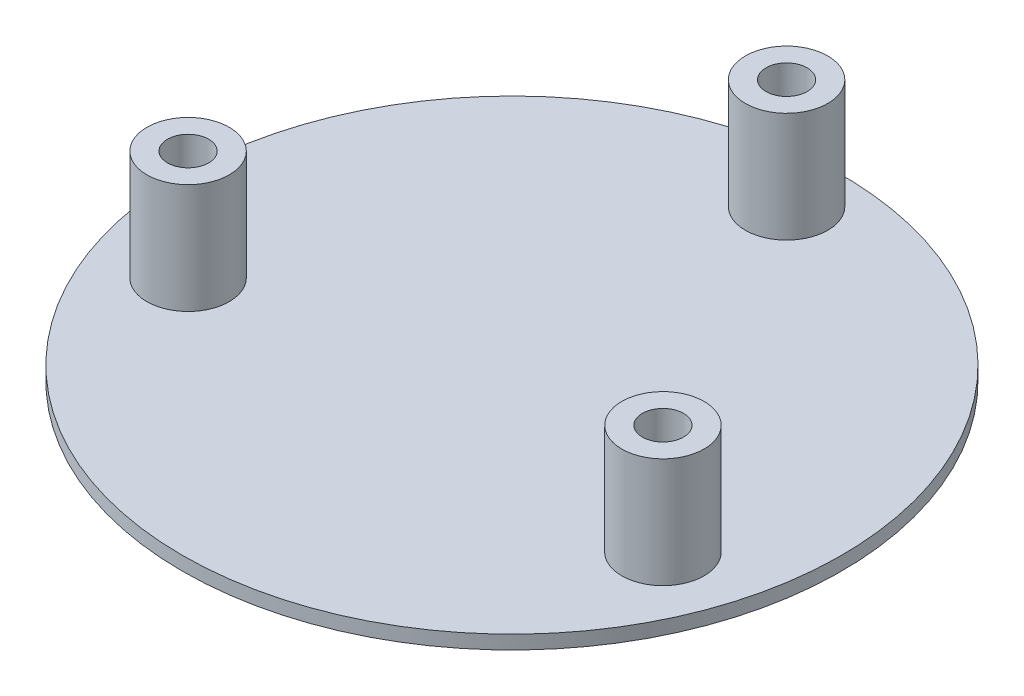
ISO-10303-21;
HEADER;
FILE_DESCRIPTION(('STEP AP214'),'2;1');
FILE_NAME('part.step','',(''),(''),'','','');
FILE_SCHEMA(('AUTOMOTIVE_DESIGN { 1 0 10303 214 1 1 1 1 }'));
ENDSEC;
DATA;
#1=APPLICATION_CONTEXT('core data for automotive mechanical design processes');
#2=APPLICATION_PROTOCOL_DEFINITION('international standard','automotive_design',2000,#1);
#3=PRODUCT_CONTEXT('',#1,'mechanical');
#4=PRODUCT('Part','Part','',(#3));
#5=PRODUCT_RELATED_PRODUCT_CATEGORY('part','',(#4));
#6=PRODUCT_DEFINITION_FORMATION('','',#4);
#7=PRODUCT_DEFINITION_CONTEXT('part definition',#1,'design');
#8=PRODUCT_DEFINITION('design','',#6,#7);
#9=PRODUCT_DEFINITION_SHAPE('','',#8);
#10=(LENGTH_UNIT() NAMED_UNIT(*) SI_UNIT(.MILLI.,.METRE.));
#11=(NAMED_UNIT(*) PLANE_ANGLE_UNIT() SI_UNIT($,.RADIAN.));
#12=(NAMED_UNIT(*) SI_UNIT($,.STERADIAN.) SOLID_ANGLE_UNIT());
#13=UNCERTAINTY_MEASURE_WITH_UNIT(LENGTH_MEASURE(1.E-05),#10,'distance_accuracy_value','');
#14=(GEOMETRIC_REPRESENTATION_CONTEXT(3) GLOBAL_UNCERTAINTY_ASSIGNED_CONTEXT((#13)) GLOBAL_UNIT_ASSIGNED_CONTEXT((#10,
#11,#12)) REPRESENTATION_CONTEXT('',''));
#15=CARTESIAN_POINT('',(0.,0.,0.));
#16=DIRECTION('',(0.,0.,1.));
#17=DIRECTION('',(1.,0.,0.));
#18=AXIS2_PLACEMENT_3D('',#15,#16,#17);
#19=CARTESIAN_POINT('',(0.,3.175,0.));
#20=DIRECTION('',(0.,1.,0.));
#21=DIRECTION('',(0.,0.,1.));
#22=AXIS2_PLACEMENT_3D('',#19,#20,#21);
#23=PLANE('',#22);
#24=CARTESIAN_POINT('',(0.,3.175,0.));
#25=DIRECTION('',(0.,1.,0.));
#26=DIRECTION('',(0.,0.,1.));
#27=AXIS2_PLACEMENT_3D('',#24,#25,#26);
#28=CIRCLE('',#27,76.2);
#29=CARTESIAN_POINT('',(0.,3.175,76.2));
#30=VERTEX_POINT('',#29);
#31=EDGE_CURVE('E46',#30,#30,#28,.T.);
#32=ORIENTED_EDGE('',*,*,#31,.T.);
#33=EDGE_LOOP('',(#32));
#34=FACE_BOUND('',#33,.T.);
#35=CARTESIAN_POINT('',(0.,3.175,-63.5));
#36=DIRECTION('',(0.,1.,0.));
#37=DIRECTION('',(0.,0.,1.));
#38=AXIS2_PLACEMENT_3D('',#35,#36,#37);
#39=CIRCLE('',#38,9.525);
#40=CARTESIAN_POINT('',(0.,3.175,-53.975));
#41=VERTEX_POINT('',#40);
#42=EDGE_CURVE('E55',#41,#41,#39,.T.);
#43=ORIENTED_EDGE('',*,*,#42,.F.);
#44=EDGE_LOOP('',(#43));
#45=FACE_BOUND('',#44,.T.);
#46=CARTESIAN_POINT('',(-54.8968429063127,3.175,19.9808167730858));
#47=DIRECTION('',(0.,1.,0.));
#48=DIRECTION('',(0.,0.,1.));
#49=AXIS2_PLACEMENT_3D('',#46,#47,#48);
#50=CIRCLE('',#49,9.525);
#51=CARTESIAN_POINT('',(-54.8968429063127,3.175,29.5058167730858));
#52=VERTEX_POINT('',#51);
#53=EDGE_CURVE('E64',#52,#52,#50,.T.);
#54=ORIENTED_EDGE('',*,*,#53,.F.);
#55=EDGE_LOOP('',(#54));
#56=FACE_BOUND('',#55,.T.);
#57=CARTESIAN_POINT('',(54.8968429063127,3.175,19.9808167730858));
#58=DIRECTION('',(0.,1.,0.));
#59=DIRECTION('',(0.,0.,1.));
#60=AXIS2_PLACEMENT_3D('',#57,#58,#59);
#61=CIRCLE('',#60,9.52500000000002);
#62=CARTESIAN_POINT('',(54.8968429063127,3.175,29.5058167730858));
#63=VERTEX_POINT('',#62);
#64=EDGE_CURVE('E73',#63,#63,#61,.T.);
#65=ORIENTED_EDGE('',*,*,#64,.F.);
#66=EDGE_LOOP('',(#65));
#67=FACE_BOUND('',#66,.T.);
#68=ADVANCED_FACE('F31',(#34,#45,#56,#67),#23,.T.);
#69=CARTESIAN_POINT('',(0.,3.175,0.));
#70=DIRECTION('',(0.,-1.,0.));
#71=DIRECTION('',(0.,0.,-1.));
#72=AXIS2_PLACEMENT_3D('',#69,#70,#71);
#73=CYLINDRICAL_SURFACE('',#72,76.2);
#74=ORIENTED_EDGE('',*,*,#31,.F.);
#75=EDGE_LOOP('',(#74));
#76=FACE_BOUND('',#75,.T.);
#77=CARTESIAN_POINT('',(0.,0.,0.));
#78=DIRECTION('',(0.,1.,0.));
#79=DIRECTION('',(0.,0.,1.));
#80=AXIS2_PLACEMENT_3D('',#77,#78,#79);
#81=CIRCLE('',#80,76.2);
#82=CARTESIAN_POINT('',(0.,0.,76.2));
#83=VERTEX_POINT('',#82);
#84=EDGE_CURVE('E49',#83,#83,#81,.T.);
#85=ORIENTED_EDGE('',*,*,#84,.T.);
#86=EDGE_LOOP('',(#85));
#87=FACE_BOUND('',#86,.T.);
#88=ADVANCED_FACE('F33',(#76,#87),#73,.T.);
#89=CARTESIAN_POINT('',(0.,0.,0.));
#90=DIRECTION('',(0.,1.,0.));
#91=DIRECTION('',(0.,0.,1.));
#92=AXIS2_PLACEMENT_3D('',#89,#90,#91);
#93=PLANE('',#92);
#94=ORIENTED_EDGE('',*,*,#84,.F.);
#95=EDGE_LOOP('',(#94));
#96=FACE_BOUND('',#95,.T.);
#97=ADVANCED_FACE('F107',(#96),#93,.F.);
#98=CARTESIAN_POINT('',(0.,28.575,-63.5));
#99=DIRECTION('',(0.,1.,0.));
#100=DIRECTION('',(0.,0.,1.));
#101=AXIS2_PLACEMENT_3D('',#98,#99,#100);
#102=PLANE('',#101);
#103=CARTESIAN_POINT('',(0.,28.575,-63.5));
#104=DIRECTION('',(0.,1.,0.));
#105=DIRECTION('',(0.,0.,1.));
#106=AXIS2_PLACEMENT_3D('',#103,#104,#105);
#107=CIRCLE('',#106,9.525);
#108=CARTESIAN_POINT('',(0.,28.575,-53.975));
#109=VERTEX_POINT('',#108);
#110=EDGE_CURVE('E52',#109,#109,#107,.T.);
#111=ORIENTED_EDGE('',*,*,#110,.T.);
#112=EDGE_LOOP('',(#111));
#113=FACE_BOUND('',#112,.T.);
#114=CARTESIAN_POINT('',(0.,28.575,-63.5));
#115=DIRECTION('',(0.,1.,0.));
#116=DIRECTION('',(0.,0.,1.));
#117=AXIS2_PLACEMENT_3D('',#114,#115,#116);
#118=CIRCLE('',#117,4.7625);
#119=CARTESIAN_POINT('',(0.,28.575,-58.7375));
#120=VERTEX_POINT('',#119);
#121=EDGE_CURVE('E58',#120,#120,#118,.T.);
#122=ORIENTED_EDGE('',*,*,#121,.F.);
#123=EDGE_LOOP('',(#122));
#124=FACE_BOUND('',#123,.T.);
#125=ADVANCED_FACE('F132',(#113,#124),#102,.T.);
#126=CARTESIAN_POINT('',(0.,28.575,-63.5));
#127=DIRECTION('',(0.,-1.,0.));
#128=DIRECTION('',(0.,0.,-1.));
#129=AXIS2_PLACEMENT_3D('',#126,#127,#128);
#130=CYLINDRICAL_SURFACE('',#129,9.525);
#131=ORIENTED_EDGE('',*,*,#110,.F.);
#132=EDGE_LOOP('',(#131));
#133=FACE_BOUND('',#132,.T.);
#134=ORIENTED_EDGE('',*,*,#42,.T.);
#135=EDGE_LOOP('',(#134));
#136=FACE_BOUND('',#135,.T.);
#137=ADVANCED_FACE('F124',(#133,#136),#130,.T.);
#138=CARTESIAN_POINT('',(0.,28.575,-63.5));
#139=DIRECTION('',(0.,-1.,0.));
#140=DIRECTION('',(0.,0.,-1.));
#141=AXIS2_PLACEMENT_3D('',#138,#139,#140);
#142=CYLINDRICAL_SURFACE('',#141,4.7625);
#143=ORIENTED_EDGE('',*,*,#121,.T.);
#144=EDGE_LOOP('',(#143));
#145=FACE_BOUND('',#144,.T.);
#146=CARTESIAN_POINT('',(0.,3.175,-63.5));
#147=DIRECTION('',(0.,1.,0.));
#148=DIRECTION('',(0.,0.,1.));
#149=AXIS2_PLACEMENT_3D('',#146,#147,#148);
#150=CIRCLE('',#149,4.7625);
#151=CARTESIAN_POINT('',(0.,3.175,-58.7375));
#152=VERTEX_POINT('',#151);
#153=EDGE_CURVE('E42',#152,#152,#150,.F.);
#154=ORIENTED_EDGE('',*,*,#153,.T.);
#155=EDGE_LOOP('',(#154));
#156=FACE_BOUND('',#155,.T.);
#157=ADVANCED_FACE('F115',(#145,#156),#142,.F.);
#158=ORIENTED_EDGE('',*,*,#153,.F.);
#159=EDGE_LOOP('',(#158));
#160=FACE_BOUND('',#159,.T.);
#161=ADVANCED_FACE('F99',(#160),#23,.T.);
#162=CARTESIAN_POINT('',(-54.8968429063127,28.575,19.9808167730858));
#163=DIRECTION('',(0.,1.,0.));
#164=DIRECTION('',(0.,0.,1.));
#165=AXIS2_PLACEMENT_3D('',#162,#163,#164);
#166=PLANE('',#165);
#167=CARTESIAN_POINT('',(-54.8968429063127,28.575,19.9808167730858));
#168=DIRECTION('',(0.,1.,0.));
#169=DIRECTION('',(0.,0.,1.));
#170=AXIS2_PLACEMENT_3D('',#167,#168,#169);
#171=CIRCLE('',#170,9.525);
#172=CARTESIAN_POINT('',(-54.8968429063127,28.575,29.5058167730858));
#173=VERTEX_POINT('',#172);
#174=EDGE_CURVE('E63',#173,#173,#171,.T.);
#175=ORIENTED_EDGE('',*,*,#174,.T.);
#176=EDGE_LOOP('',(#175));
#177=FACE_BOUND('',#176,.T.);
#178=CARTESIAN_POINT('',(-54.8968429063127,28.575,19.9808167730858));
#179=DIRECTION('',(0.,1.,0.));
#180=DIRECTION('',(0.,0.,1.));
#181=AXIS2_PLACEMENT_3D('',#178,#179,#180);
#182=CIRCLE('',#181,4.7625);
#183=CARTESIAN_POINT('',(-54.8968429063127,28.575,24.7433167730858));
#184=VERTEX_POINT('',#183);
#185=EDGE_CURVE('E67',#184,#184,#182,.T.);
#186=ORIENTED_EDGE('',*,*,#185,.F.);
#187=EDGE_LOOP('',(#186));
#188=FACE_BOUND('',#187,.T.);
#189=ADVANCED_FACE('F114',(#177,#188),#166,.T.);
#190=CARTESIAN_POINT('',(-54.8968429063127,28.575,19.9808167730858));
#191=DIRECTION('',(0.,-1.,0.));
#192=DIRECTION('',(0.,0.,-1.));
#193=AXIS2_PLACEMENT_3D('',#190,#191,#192);
#194=CYLINDRICAL_SURFACE('',#193,9.525);
#195=ORIENTED_EDGE('',*,*,#174,.F.);
#196=EDGE_LOOP('',(#195));
#197=FACE_BOUND('',#196,.T.);
#198=ORIENTED_EDGE('',*,*,#53,.T.);
#199=EDGE_LOOP('',(#198));
#200=FACE_BOUND('',#199,.T.);
#201=ADVANCED_FACE('F121',(#197,#200),#194,.T.);
#202=CARTESIAN_POINT('',(-54.8968429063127,28.575,19.9808167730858));
#203=DIRECTION('',(0.,-1.,0.));
#204=DIRECTION('',(0.,0.,-1.));
#205=AXIS2_PLACEMENT_3D('',#202,#203,#204);
#206=CYLINDRICAL_SURFACE('',#205,4.7625);
#207=ORIENTED_EDGE('',*,*,#185,.T.);
#208=EDGE_LOOP('',(#207));
#209=FACE_BOUND('',#208,.T.);
#210=CARTESIAN_POINT('',(-54.8968429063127,3.175,19.9808167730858));
#211=DIRECTION('',(0.,1.,0.));
#212=DIRECTION('',(0.,0.,1.));
#213=AXIS2_PLACEMENT_3D('',#210,#211,#212);
#214=CIRCLE('',#213,4.7625);
#215=CARTESIAN_POINT('',(-54.8968429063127,3.175,24.7433167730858));
#216=VERTEX_POINT('',#215);
#217=EDGE_CURVE('E38',#216,#216,#214,.F.);
#218=ORIENTED_EDGE('',*,*,#217,.T.);
#219=EDGE_LOOP('',(#218));
#220=FACE_BOUND('',#219,.T.);
#221=ADVANCED_FACE('F96',(#209,#220),#206,.F.);
#222=ORIENTED_EDGE('',*,*,#217,.F.);
#223=EDGE_LOOP('',(#222));
#224=FACE_BOUND('',#223,.T.);
#225=ADVANCED_FACE('F87',(#224),#23,.T.);
#226=CARTESIAN_POINT('',(54.8968429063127,28.575,19.9808167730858));
#227=DIRECTION('',(0.,1.,0.));
#228=DIRECTION('',(0.,0.,1.));
#229=AXIS2_PLACEMENT_3D('',#226,#227,#228);
#230=PLANE('',#229);
#231=CARTESIAN_POINT('',(54.8968429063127,28.575,19.9808167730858));
#232=DIRECTION('',(0.,1.,0.));
#233=DIRECTION('',(0.,0.,1.));
#234=AXIS2_PLACEMENT_3D('',#231,#232,#233);
#235=CIRCLE('',#234,9.52500000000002);
#236=CARTESIAN_POINT('',(54.8968429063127,28.575,29.5058167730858));
#237=VERTEX_POINT('',#236);
#238=EDGE_CURVE('E72',#237,#237,#235,.T.);
#239=ORIENTED_EDGE('',*,*,#238,.T.);
#240=EDGE_LOOP('',(#239));
#241=FACE_BOUND('',#240,.T.);
#242=CARTESIAN_POINT('',(54.8968429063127,28.575,19.9808167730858));
#243=DIRECTION('',(0.,1.,0.));
#244=DIRECTION('',(0.,0.,1.));
#245=AXIS2_PLACEMENT_3D('',#242,#243,#244);
#246=CIRCLE('',#245,4.7625);
#247=CARTESIAN_POINT('',(54.8968429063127,28.575,24.7433167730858));
#248=VERTEX_POINT('',#247);
#249=EDGE_CURVE('E76',#248,#248,#246,.T.);
#250=ORIENTED_EDGE('',*,*,#249,.F.);
#251=EDGE_LOOP('',(#250));
#252=FACE_BOUND('',#251,.T.);
#253=ADVANCED_FACE('F84',(#241,#252),#230,.T.);
#254=CARTESIAN_POINT('',(54.8968429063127,28.575,19.9808167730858));
#255=DIRECTION('',(0.,-1.,0.));
#256=DIRECTION('',(0.,0.,-1.));
#257=AXIS2_PLACEMENT_3D('',#254,#255,#256);
#258=CYLINDRICAL_SURFACE('',#257,9.52500000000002);
#259=ORIENTED_EDGE('',*,*,#238,.F.);
#260=EDGE_LOOP('',(#259));
#261=FACE_BOUND('',#260,.T.);
#262=ORIENTED_EDGE('',*,*,#64,.T.);
#263=EDGE_LOOP('',(#262));
#264=FACE_BOUND('',#263,.T.);
#265=ADVANCED_FACE('F86',(#261,#264),#258,.T.);
#266=CARTESIAN_POINT('',(54.8968429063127,28.575,19.9808167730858));
#267=DIRECTION('',(0.,-1.,0.));
#268=DIRECTION('',(0.,0.,-1.));
#269=AXIS2_PLACEMENT_3D('',#266,#267,#268);
#270=CYLINDRICAL_SURFACE('',#269,4.7625);
#271=ORIENTED_EDGE('',*,*,#249,.T.);
#272=EDGE_LOOP('',(#271));
#273=FACE_BOUND('',#272,.T.);
#274=CARTESIAN_POINT('',(54.8968429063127,3.175,19.9808167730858));
#275=DIRECTION('',(0.,1.,0.));
#276=DIRECTION('',(0.,0.,1.));
#277=AXIS2_PLACEMENT_3D('',#274,#275,#276);
#278=CIRCLE('',#277,4.7625);
#279=CARTESIAN_POINT('',(54.8968429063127,3.175,24.7433167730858));
#280=VERTEX_POINT('',#279);
#281=EDGE_CURVE('E10',#280,#280,#278,.F.);
#282=ORIENTED_EDGE('',*,*,#281,.T.);
#283=EDGE_LOOP('',(#282));
#284=FACE_BOUND('',#283,.T.);
#285=ADVANCED_FACE('F82',(#273,#284),#270,.F.);
#286=ORIENTED_EDGE('',*,*,#281,.F.);
#287=EDGE_LOOP('',(#286));
#288=FACE_BOUND('',#287,.T.);
#289=ADVANCED_FACE('F100',(#288),#23,.T.);
#290=CLOSED_SHELL('',(#68,#88,#97,#125,#137,#157,#161,#189,#201,#221,#225,#253,#265,#285,#289));
#291=MANIFOLD_SOLID_BREP('B2',#290);
#292=ADVANCED_BREP_SHAPE_REPRESENTATION('',(#18,#291),#14);
#293=SHAPE_DEFINITION_REPRESENTATION(#9,#292);
ENDSEC;
END-ISO-10303-21;
